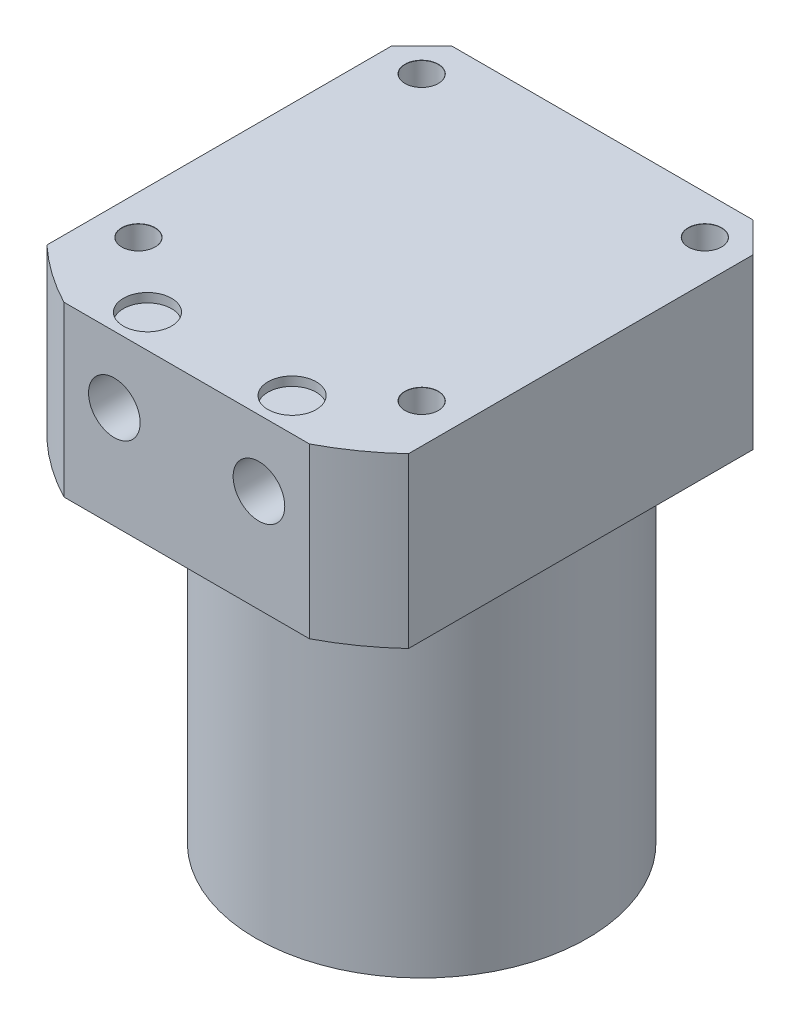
ISO-10303-21;
HEADER;
FILE_DESCRIPTION(('STEP AP214'),'2;1');
FILE_NAME('part.step','',(''),(''),'','','');
FILE_SCHEMA(('AUTOMOTIVE_DESIGN { 1 0 10303 214 1 1 1 1 }'));
ENDSEC;
DATA;
#1=APPLICATION_CONTEXT('core data for automotive mechanical design processes');
#2=APPLICATION_PROTOCOL_DEFINITION('international standard','automotive_design',2000,#1);
#3=PRODUCT_CONTEXT('',#1,'mechanical');
#4=PRODUCT('Part','Part','',(#3));
#5=PRODUCT_RELATED_PRODUCT_CATEGORY('part','',(#4));
#6=PRODUCT_DEFINITION_FORMATION('','',#4);
#7=PRODUCT_DEFINITION_CONTEXT('part definition',#1,'design');
#8=PRODUCT_DEFINITION('design','',#6,#7);
#9=PRODUCT_DEFINITION_SHAPE('','',#8);
#10=(LENGTH_UNIT() NAMED_UNIT(*) SI_UNIT(.MILLI.,.METRE.));
#11=(NAMED_UNIT(*) PLANE_ANGLE_UNIT() SI_UNIT($,.RADIAN.));
#12=(NAMED_UNIT(*) SI_UNIT($,.STERADIAN.) SOLID_ANGLE_UNIT());
#13=UNCERTAINTY_MEASURE_WITH_UNIT(LENGTH_MEASURE(1.E-05),#10,'distance_accuracy_value','');
#14=(GEOMETRIC_REPRESENTATION_CONTEXT(3) GLOBAL_UNCERTAINTY_ASSIGNED_CONTEXT((#13)) GLOBAL_UNIT_ASSIGNED_CONTEXT((#10,
#11,#12)) REPRESENTATION_CONTEXT('',''));
#15=CARTESIAN_POINT('',(0.,0.,0.));
#16=DIRECTION('',(0.,0.,1.));
#17=DIRECTION('',(1.,0.,0.));
#18=AXIS2_PLACEMENT_3D('',#15,#16,#17);
#19=CARTESIAN_POINT('',(-27.5,59.,0.));
#20=DIRECTION('',(0.,-1.,0.));
#21=DIRECTION('',(0.,0.,-1.));
#22=AXIS2_PLACEMENT_3D('',#19,#20,#21);
#23=PLANE('',#22);
#24=CARTESIAN_POINT('',(-23.5,59.,-23.5));
#25=DIRECTION('',(0.,-1.,0.));
#26=DIRECTION('',(0.,0.,-1.));
#27=AXIS2_PLACEMENT_3D('',#24,#25,#26);
#28=CIRCLE('',#27,5.);
#29=CARTESIAN_POINT('',(-23.5,59.,-28.5));
#30=VERTEX_POINT('',#29);
#31=EDGE_CURVE('E336',#30,#30,#28,.T.);
#32=ORIENTED_EDGE('',*,*,#31,.F.);
#33=EDGE_LOOP('',(#32));
#34=FACE_BOUND('',#33,.T.);
#35=CARTESIAN_POINT('',(23.5,59.,-23.5));
#36=DIRECTION('',(0.,-1.,0.));
#37=DIRECTION('',(0.,0.,-1.));
#38=AXIS2_PLACEMENT_3D('',#35,#36,#37);
#39=CIRCLE('',#38,5.);
#40=CARTESIAN_POINT('',(23.5,59.,-28.5));
#41=VERTEX_POINT('',#40);
#42=EDGE_CURVE('E351',#41,#41,#39,.T.);
#43=ORIENTED_EDGE('',*,*,#42,.F.);
#44=EDGE_LOOP('',(#43));
#45=FACE_BOUND('',#44,.T.);
#46=CARTESIAN_POINT('',(23.5,59.,23.5));
#47=DIRECTION('',(0.,-1.,0.));
#48=DIRECTION('',(0.,0.,-1.));
#49=AXIS2_PLACEMENT_3D('',#46,#47,#48);
#50=CIRCLE('',#49,5.);
#51=CARTESIAN_POINT('',(23.5,59.,18.5));
#52=VERTEX_POINT('',#51);
#53=EDGE_CURVE('E366',#52,#52,#50,.T.);
#54=ORIENTED_EDGE('',*,*,#53,.F.);
#55=EDGE_LOOP('',(#54));
#56=FACE_BOUND('',#55,.T.);
#57=CARTESIAN_POINT('',(-23.5,59.,23.5));
#58=DIRECTION('',(0.,-1.,0.));
#59=DIRECTION('',(0.,0.,-1.));
#60=AXIS2_PLACEMENT_3D('',#57,#58,#59);
#61=CIRCLE('',#60,5.);
#62=CARTESIAN_POINT('',(-23.5,59.,18.5));
#63=VERTEX_POINT('',#62);
#64=EDGE_CURVE('E381',#63,#63,#61,.T.);
#65=ORIENTED_EDGE('',*,*,#64,.F.);
#66=EDGE_LOOP('',(#65));
#67=FACE_BOUND('',#66,.T.);
#68=CARTESIAN_POINT('',(0.,59.,0.));
#69=DIRECTION('',(0.,1.,0.));
#70=DIRECTION('',(0.,0.,1.));
#71=AXIS2_PLACEMENT_3D('',#68,#69,#70);
#72=CIRCLE('',#71,27.5);
#73=CARTESIAN_POINT('',(0.,59.,27.5));
#74=VERTEX_POINT('',#73);
#75=EDGE_CURVE('E133',#74,#74,#72,.T.);
#76=ORIENTED_EDGE('',*,*,#75,.T.);
#77=EDGE_LOOP('',(#76));
#78=FACE_BOUND('',#77,.T.);
#79=DIRECTION('',(1.,0.,0.));
#80=VECTOR('',#79,1.);
#81=CARTESIAN_POINT('',(-27.5,59.,-30.));
#82=LINE('',#81,#80);
#83=CARTESIAN_POINT('',(-25.,59.,-30.));
#84=VERTEX_POINT('',#83);
#85=CARTESIAN_POINT('',(25.,59.,-30.));
#86=VERTEX_POINT('',#85);
#87=EDGE_CURVE('E107',#84,#86,#82,.T.);
#88=ORIENTED_EDGE('',*,*,#87,.T.);
#89=DIRECTION('',(-0.707106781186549,0.,-0.707106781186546));
#90=VECTOR('',#89,1.);
#91=CARTESIAN_POINT('',(13.7499999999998,59.,-41.2500000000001));
#92=LINE('',#91,#90);
#93=CARTESIAN_POINT('',(30.,59.,-25.));
#94=VERTEX_POINT('',#93);
#95=EDGE_CURVE('E41',#86,#94,#92,.F.);
#96=ORIENTED_EDGE('',*,*,#95,.T.);
#97=DIRECTION('',(0.,0.,1.));
#98=VECTOR('',#97,1.);
#99=CARTESIAN_POINT('',(30.,59.,0.));
#100=LINE('',#99,#98);
#101=CARTESIAN_POINT('',(30.,59.,32.1869538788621));
#102=VERTEX_POINT('',#101);
#103=EDGE_CURVE('E122',#94,#102,#100,.T.);
#104=ORIENTED_EDGE('',*,*,#103,.T.);
#105=CARTESIAN_POINT('',(0.,59.,0.));
#106=DIRECTION('',(0.,1.,0.));
#107=DIRECTION('',(0.,0.,1.));
#108=AXIS2_PLACEMENT_3D('',#105,#106,#107);
#109=CIRCLE('',#108,44.);
#110=CARTESIAN_POINT('',(20.3715487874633,59.,39.));
#111=VERTEX_POINT('',#110);
#112=EDGE_CURVE('E130',#111,#102,#109,.T.);
#113=ORIENTED_EDGE('',*,*,#112,.F.);
#114=DIRECTION('',(-1.,0.,0.));
#115=VECTOR('',#114,1.);
#116=CARTESIAN_POINT('',(-27.5,59.,39.));
#117=LINE('',#116,#115);
#118=CARTESIAN_POINT('',(-20.3715487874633,59.,39.));
#119=VERTEX_POINT('',#118);
#120=EDGE_CURVE('E177',#111,#119,#117,.T.);
#121=ORIENTED_EDGE('',*,*,#120,.T.);
#122=CARTESIAN_POINT('',(-30.,59.,32.1869538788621));
#123=VERTEX_POINT('',#122);
#124=EDGE_CURVE('E125',#123,#119,#109,.T.);
#125=ORIENTED_EDGE('',*,*,#124,.F.);
#126=DIRECTION('',(0.,0.,-1.));
#127=VECTOR('',#126,1.);
#128=CARTESIAN_POINT('',(-30.,59.,0.));
#129=LINE('',#128,#127);
#130=CARTESIAN_POINT('',(-30.,59.,-25.));
#131=VERTEX_POINT('',#130);
#132=EDGE_CURVE('E113',#123,#131,#129,.T.);
#133=ORIENTED_EDGE('',*,*,#132,.T.);
#134=DIRECTION('',(-0.707106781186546,0.,0.707106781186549));
#135=VECTOR('',#134,1.);
#136=CARTESIAN_POINT('',(-41.25,59.,-13.7499999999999));
#137=LINE('',#136,#135);
#138=EDGE_CURVE('E153',#131,#84,#137,.F.);
#139=ORIENTED_EDGE('',*,*,#138,.T.);
#140=EDGE_LOOP('',(#88,#96,#104,#113,#121,#125,#133,#139));
#141=FACE_BOUND('',#140,.T.);
#142=ADVANCED_FACE('F33',(#34,#45,#56,#67,#78,#141),#23,.T.);
#143=CARTESIAN_POINT('',(0.,87.0508296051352,0.));
#144=DIRECTION('',(0.,1.,0.));
#145=DIRECTION('',(0.,0.,1.));
#146=AXIS2_PLACEMENT_3D('',#143,#144,#145);
#147=CYLINDRICAL_SURFACE('',#146,44.);
#148=ORIENTED_EDGE('',*,*,#112,.T.);
#149=DIRECTION('',(0.,1.,0.));
#150=VECTOR('',#149,1.);
#151=CARTESIAN_POINT('',(30.,87.0508296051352,32.1869538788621));
#152=LINE('',#151,#150);
#153=CARTESIAN_POINT('',(30.,87.,32.1869538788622));
#154=VERTEX_POINT('',#153);
#155=EDGE_CURVE('E126',#102,#154,#152,.T.);
#156=ORIENTED_EDGE('',*,*,#155,.T.);
#157=CARTESIAN_POINT('',(0.,87.,0.));
#158=DIRECTION('',(0.,1.,0.));
#159=DIRECTION('',(0.,0.,1.));
#160=AXIS2_PLACEMENT_3D('',#157,#158,#159);
#161=CIRCLE('',#160,44.);
#162=CARTESIAN_POINT('',(20.3715487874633,87.,39.));
#163=VERTEX_POINT('',#162);
#164=EDGE_CURVE('E121',#163,#154,#161,.T.);
#165=ORIENTED_EDGE('',*,*,#164,.F.);
#166=DIRECTION('',(0.,1.,0.));
#167=VECTOR('',#166,1.);
#168=CARTESIAN_POINT('',(20.3715487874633,87.0508296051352,39.));
#169=LINE('',#168,#167);
#170=EDGE_CURVE('E180',#163,#111,#169,.F.);
#171=ORIENTED_EDGE('',*,*,#170,.T.);
#172=EDGE_LOOP('',(#148,#156,#165,#171));
#173=FACE_BOUND('',#172,.T.);
#174=ADVANCED_FACE('F184',(#173),#147,.T.);
#175=ORIENTED_EDGE('',*,*,#124,.T.);
#176=DIRECTION('',(0.,1.,0.));
#177=VECTOR('',#176,1.);
#178=CARTESIAN_POINT('',(-20.3715487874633,87.0508296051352,39.));
#179=LINE('',#178,#177);
#180=CARTESIAN_POINT('',(-20.3715487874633,87.,39.));
#181=VERTEX_POINT('',#180);
#182=EDGE_CURVE('E120',#119,#181,#179,.T.);
#183=ORIENTED_EDGE('',*,*,#182,.T.);
#184=CARTESIAN_POINT('',(-30.,87.,32.1869538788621));
#185=VERTEX_POINT('',#184);
#186=EDGE_CURVE('E104',#185,#181,#161,.T.);
#187=ORIENTED_EDGE('',*,*,#186,.F.);
#188=DIRECTION('',(0.,1.,0.));
#189=VECTOR('',#188,1.);
#190=CARTESIAN_POINT('',(-30.,87.0508296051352,32.1869538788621));
#191=LINE('',#190,#189);
#192=EDGE_CURVE('E111',#185,#123,#191,.F.);
#193=ORIENTED_EDGE('',*,*,#192,.T.);
#194=EDGE_LOOP('',(#175,#183,#187,#193));
#195=FACE_BOUND('',#194,.T.);
#196=ADVANCED_FACE('F119',(#195),#147,.T.);
#197=CARTESIAN_POINT('',(-44.,87.,0.));
#198=DIRECTION('',(0.,1.,0.));
#199=DIRECTION('',(0.,0.,1.));
#200=AXIS2_PLACEMENT_3D('',#197,#198,#199);
#201=PLANE('',#200);
#202=CARTESIAN_POINT('',(-23.5,87.,-23.5));
#203=DIRECTION('',(0.,-1.,0.));
#204=DIRECTION('',(0.,0.,-1.));
#205=AXIS2_PLACEMENT_3D('',#202,#203,#204);
#206=CIRCLE('',#205,2.77499999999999);
#207=CARTESIAN_POINT('',(-23.5,87.,-26.275));
#208=VERTEX_POINT('',#207);
#209=EDGE_CURVE('E337',#208,#208,#206,.T.);
#210=ORIENTED_EDGE('',*,*,#209,.T.);
#211=EDGE_LOOP('',(#210));
#212=FACE_BOUND('',#211,.T.);
#213=CARTESIAN_POINT('',(23.5,87.,-23.5));
#214=DIRECTION('',(0.,-1.,0.));
#215=DIRECTION('',(0.,0.,-1.));
#216=AXIS2_PLACEMENT_3D('',#213,#214,#215);
#217=CIRCLE('',#216,2.77499999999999);
#218=CARTESIAN_POINT('',(23.5,87.,-26.275));
#219=VERTEX_POINT('',#218);
#220=EDGE_CURVE('E348',#219,#219,#217,.T.);
#221=ORIENTED_EDGE('',*,*,#220,.T.);
#222=EDGE_LOOP('',(#221));
#223=FACE_BOUND('',#222,.T.);
#224=CARTESIAN_POINT('',(23.5,87.,23.5));
#225=DIRECTION('',(0.,-1.,0.));
#226=DIRECTION('',(0.,0.,-1.));
#227=AXIS2_PLACEMENT_3D('',#224,#225,#226);
#228=CIRCLE('',#227,2.77499999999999);
#229=CARTESIAN_POINT('',(23.5,87.,20.725));
#230=VERTEX_POINT('',#229);
#231=EDGE_CURVE('E363',#230,#230,#228,.T.);
#232=ORIENTED_EDGE('',*,*,#231,.T.);
#233=EDGE_LOOP('',(#232));
#234=FACE_BOUND('',#233,.T.);
#235=CARTESIAN_POINT('',(-23.5,87.,23.5));
#236=DIRECTION('',(0.,-1.,0.));
#237=DIRECTION('',(0.,0.,-1.));
#238=AXIS2_PLACEMENT_3D('',#235,#236,#237);
#239=CIRCLE('',#238,2.77499999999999);
#240=CARTESIAN_POINT('',(-23.5,87.,20.725));
#241=VERTEX_POINT('',#240);
#242=EDGE_CURVE('E378',#241,#241,#239,.T.);
#243=ORIENTED_EDGE('',*,*,#242,.T.);
#244=EDGE_LOOP('',(#243));
#245=FACE_BOUND('',#244,.T.);
#246=CARTESIAN_POINT('',(-12.,87.,33.5));
#247=DIRECTION('',(0.,1.,0.));
#248=DIRECTION('',(0.,0.,1.));
#249=AXIS2_PLACEMENT_3D('',#246,#247,#248);
#250=CIRCLE('',#249,4.);
#251=CARTESIAN_POINT('',(-12.,87.,37.5));
#252=VERTEX_POINT('',#251);
#253=EDGE_CURVE('E405',#252,#252,#250,.T.);
#254=ORIENTED_EDGE('',*,*,#253,.F.);
#255=EDGE_LOOP('',(#254));
#256=FACE_BOUND('',#255,.T.);
#257=CARTESIAN_POINT('',(12.,87.,33.5));
#258=DIRECTION('',(0.,1.,0.));
#259=DIRECTION('',(0.,0.,1.));
#260=AXIS2_PLACEMENT_3D('',#257,#258,#259);
#261=CIRCLE('',#260,4.);
#262=CARTESIAN_POINT('',(12.,87.,37.5));
#263=VERTEX_POINT('',#262);
#264=EDGE_CURVE('E170',#263,#263,#261,.T.);
#265=ORIENTED_EDGE('',*,*,#264,.F.);
#266=EDGE_LOOP('',(#265));
#267=FACE_BOUND('',#266,.T.);
#268=DIRECTION('',(0.,0.,-1.));
#269=VECTOR('',#268,1.);
#270=CARTESIAN_POINT('',(30.,87.,0.));
#271=LINE('',#270,#269);
#272=CARTESIAN_POINT('',(30.,87.,-25.));
#273=VERTEX_POINT('',#272);
#274=EDGE_CURVE('E139',#154,#273,#271,.T.);
#275=ORIENTED_EDGE('',*,*,#274,.T.);
#276=DIRECTION('',(0.707106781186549,0.,0.707106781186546));
#277=VECTOR('',#276,1.);
#278=CARTESIAN_POINT('',(5.4999999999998,87.,-49.5000000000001));
#279=LINE('',#278,#277);
#280=CARTESIAN_POINT('',(25.,87.,-30.));
#281=VERTEX_POINT('',#280);
#282=EDGE_CURVE('E147',#273,#281,#279,.F.);
#283=ORIENTED_EDGE('',*,*,#282,.T.);
#284=DIRECTION('',(-1.,0.,0.));
#285=VECTOR('',#284,1.);
#286=CARTESIAN_POINT('',(-30.,87.,-30.));
#287=LINE('',#286,#285);
#288=CARTESIAN_POINT('',(-25.,87.,-30.));
#289=VERTEX_POINT('',#288);
#290=EDGE_CURVE('E108',#281,#289,#287,.T.);
#291=ORIENTED_EDGE('',*,*,#290,.T.);
#292=DIRECTION('',(0.707106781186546,0.,-0.707106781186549));
#293=VECTOR('',#292,1.);
#294=CARTESIAN_POINT('',(-49.4999999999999,87.,-5.49999999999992));
#295=LINE('',#294,#293);
#296=CARTESIAN_POINT('',(-30.,87.,-25.));
#297=VERTEX_POINT('',#296);
#298=EDGE_CURVE('E106',#289,#297,#295,.F.);
#299=ORIENTED_EDGE('',*,*,#298,.T.);
#300=DIRECTION('',(0.,0.,1.));
#301=VECTOR('',#300,1.);
#302=CARTESIAN_POINT('',(-30.,87.,-30.));
#303=LINE('',#302,#301);
#304=EDGE_CURVE('E98',#297,#185,#303,.T.);
#305=ORIENTED_EDGE('',*,*,#304,.T.);
#306=ORIENTED_EDGE('',*,*,#186,.T.);
#307=DIRECTION('',(1.,0.,0.));
#308=VECTOR('',#307,1.);
#309=CARTESIAN_POINT('',(-44.,87.,39.));
#310=LINE('',#309,#308);
#311=EDGE_CURVE('E141',#181,#163,#310,.T.);
#312=ORIENTED_EDGE('',*,*,#311,.T.);
#313=ORIENTED_EDGE('',*,*,#164,.T.);
#314=EDGE_LOOP('',(#275,#283,#291,#299,#305,#306,#312,#313));
#315=FACE_BOUND('',#314,.T.);
#316=ADVANCED_FACE('F101',(#212,#223,#234,#245,#256,#267,#315),#201,.T.);
#317=CARTESIAN_POINT('',(0.,0.,0.));
#318=DIRECTION('',(0.,-1.,0.));
#319=DIRECTION('',(0.,0.,-1.));
#320=AXIS2_PLACEMENT_3D('',#317,#318,#319);
#321=PLANE('',#320);
#322=CARTESIAN_POINT('',(0.,0.,0.));
#323=DIRECTION('',(0.,1.,0.));
#324=DIRECTION('',(0.,0.,1.));
#325=AXIS2_PLACEMENT_3D('',#322,#323,#324);
#326=CIRCLE('',#325,27.5);
#327=CARTESIAN_POINT('',(0.,0.,27.5));
#328=VERTEX_POINT('',#327);
#329=EDGE_CURVE('E136',#328,#328,#326,.T.);
#330=ORIENTED_EDGE('',*,*,#329,.F.);
#331=EDGE_LOOP('',(#330));
#332=FACE_BOUND('',#331,.T.);
#333=ADVANCED_FACE('F212',(#332),#321,.T.);
#334=CARTESIAN_POINT('',(0.,87.0508296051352,0.));
#335=DIRECTION('',(0.,1.,0.));
#336=DIRECTION('',(0.,0.,1.));
#337=AXIS2_PLACEMENT_3D('',#334,#335,#336);
#338=CYLINDRICAL_SURFACE('',#337,27.5);
#339=ORIENTED_EDGE('',*,*,#329,.T.);
#340=EDGE_LOOP('',(#339));
#341=FACE_BOUND('',#340,.T.);
#342=ORIENTED_EDGE('',*,*,#75,.F.);
#343=EDGE_LOOP('',(#342));
#344=FACE_BOUND('',#343,.T.);
#345=ADVANCED_FACE('F209',(#341,#344),#338,.T.);
#346=CARTESIAN_POINT('',(-30.,0.,-30.));
#347=DIRECTION('',(0.,0.,-1.));
#348=DIRECTION('',(-1.,0.,0.));
#349=AXIS2_PLACEMENT_3D('',#346,#347,#348);
#350=PLANE('',#349);
#351=ORIENTED_EDGE('',*,*,#290,.F.);
#352=DIRECTION('',(0.,-1.,0.));
#353=VECTOR('',#352,1.);
#354=CARTESIAN_POINT('',(25.,0.,-30.));
#355=LINE('',#354,#353);
#356=EDGE_CURVE('E54',#281,#86,#355,.T.);
#357=ORIENTED_EDGE('',*,*,#356,.T.);
#358=ORIENTED_EDGE('',*,*,#87,.F.);
#359=DIRECTION('',(0.,1.,0.));
#360=VECTOR('',#359,1.);
#361=CARTESIAN_POINT('',(-25.,0.,-30.));
#362=LINE('',#361,#360);
#363=EDGE_CURVE('E149',#84,#289,#362,.T.);
#364=ORIENTED_EDGE('',*,*,#363,.T.);
#365=EDGE_LOOP('',(#351,#357,#358,#364));
#366=FACE_BOUND('',#365,.T.);
#367=ADVANCED_FACE('F165',(#366),#350,.T.);
#368=CARTESIAN_POINT('',(-30.,0.,-30.));
#369=DIRECTION('',(-1.,0.,0.));
#370=DIRECTION('',(0.,0.,1.));
#371=AXIS2_PLACEMENT_3D('',#368,#369,#370);
#372=PLANE('',#371);
#373=ORIENTED_EDGE('',*,*,#304,.F.);
#374=DIRECTION('',(0.,-1.,0.));
#375=VECTOR('',#374,1.);
#376=CARTESIAN_POINT('',(-30.,0.,-25.));
#377=LINE('',#376,#375);
#378=EDGE_CURVE('E12',#297,#131,#377,.T.);
#379=ORIENTED_EDGE('',*,*,#378,.T.);
#380=ORIENTED_EDGE('',*,*,#132,.F.);
#381=ORIENTED_EDGE('',*,*,#192,.F.);
#382=EDGE_LOOP('',(#373,#379,#380,#381));
#383=FACE_BOUND('',#382,.T.);
#384=ADVANCED_FACE('F112',(#383),#372,.T.);
#385=CARTESIAN_POINT('',(30.,0.,-30.));
#386=DIRECTION('',(1.,0.,0.));
#387=DIRECTION('',(0.,0.,-1.));
#388=AXIS2_PLACEMENT_3D('',#385,#386,#387);
#389=PLANE('',#388);
#390=ORIENTED_EDGE('',*,*,#103,.F.);
#391=DIRECTION('',(0.,1.,0.));
#392=VECTOR('',#391,1.);
#393=CARTESIAN_POINT('',(30.,0.,-25.));
#394=LINE('',#393,#392);
#395=EDGE_CURVE('E143',#94,#273,#394,.T.);
#396=ORIENTED_EDGE('',*,*,#395,.T.);
#397=ORIENTED_EDGE('',*,*,#274,.F.);
#398=ORIENTED_EDGE('',*,*,#155,.F.);
#399=EDGE_LOOP('',(#390,#396,#397,#398));
#400=FACE_BOUND('',#399,.T.);
#401=ADVANCED_FACE('F162',(#400),#389,.T.);
#402=CARTESIAN_POINT('',(-30.,0.,39.));
#403=DIRECTION('',(0.,0.,1.));
#404=DIRECTION('',(1.,0.,0.));
#405=AXIS2_PLACEMENT_3D('',#402,#403,#404);
#406=PLANE('',#405);
#407=CARTESIAN_POINT('',(-12.,76.,39.));
#408=DIRECTION('',(0.,0.,1.));
#409=DIRECTION('',(1.,0.,0.));
#410=AXIS2_PLACEMENT_3D('',#407,#408,#409);
#411=CIRCLE('',#410,4.283);
#412=CARTESIAN_POINT('',(-7.717,76.,39.));
#413=VERTEX_POINT('',#412);
#414=EDGE_CURVE('E393',#413,#413,#411,.T.);
#415=ORIENTED_EDGE('',*,*,#414,.F.);
#416=EDGE_LOOP('',(#415));
#417=FACE_BOUND('',#416,.T.);
#418=CARTESIAN_POINT('',(12.,76.,39.));
#419=DIRECTION('',(0.,0.,1.));
#420=DIRECTION('',(1.,0.,0.));
#421=AXIS2_PLACEMENT_3D('',#418,#419,#420);
#422=CIRCLE('',#421,4.283);
#423=CARTESIAN_POINT('',(16.283,76.,39.));
#424=VERTEX_POINT('',#423);
#425=EDGE_CURVE('E399',#424,#424,#422,.T.);
#426=ORIENTED_EDGE('',*,*,#425,.F.);
#427=EDGE_LOOP('',(#426));
#428=FACE_BOUND('',#427,.T.);
#429=ORIENTED_EDGE('',*,*,#311,.F.);
#430=ORIENTED_EDGE('',*,*,#182,.F.);
#431=ORIENTED_EDGE('',*,*,#120,.F.);
#432=ORIENTED_EDGE('',*,*,#170,.F.);
#433=EDGE_LOOP('',(#429,#430,#431,#432));
#434=FACE_BOUND('',#433,.T.);
#435=ADVANCED_FACE('F186',(#417,#428,#434),#406,.T.);
#436=CARTESIAN_POINT('',(30.,0.,-25.));
#437=DIRECTION('',(-0.707106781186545,0.,0.707106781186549));
#438=DIRECTION('',(0.707106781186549,0.,0.707106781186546));
#439=AXIS2_PLACEMENT_3D('',#436,#437,#438);
#440=PLANE('',#439);
#441=ORIENTED_EDGE('',*,*,#95,.F.);
#442=ORIENTED_EDGE('',*,*,#356,.F.);
#443=ORIENTED_EDGE('',*,*,#282,.F.);
#444=ORIENTED_EDGE('',*,*,#395,.F.);
#445=EDGE_LOOP('',(#441,#442,#443,#444));
#446=FACE_BOUND('',#445,.T.);
#447=ADVANCED_FACE('F164',(#446),#440,.F.);
#448=CARTESIAN_POINT('',(-25.,0.,-30.));
#449=DIRECTION('',(0.707106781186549,0.,0.707106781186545));
#450=DIRECTION('',(0.707106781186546,0.,-0.707106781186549));
#451=AXIS2_PLACEMENT_3D('',#448,#449,#450);
#452=PLANE('',#451);
#453=ORIENTED_EDGE('',*,*,#138,.F.);
#454=ORIENTED_EDGE('',*,*,#378,.F.);
#455=ORIENTED_EDGE('',*,*,#298,.F.);
#456=ORIENTED_EDGE('',*,*,#363,.F.);
#457=EDGE_LOOP('',(#453,#454,#455,#456));
#458=FACE_BOUND('',#457,.T.);
#459=ADVANCED_FACE('F35',(#458),#452,.F.);
#460=CARTESIAN_POINT('',(12.,85.5,33.5));
#461=DIRECTION('',(0.,-1.,0.));
#462=DIRECTION('',(0.,0.,-1.));
#463=AXIS2_PLACEMENT_3D('',#460,#461,#462);
#464=PLANE('',#463);
#465=CARTESIAN_POINT('',(12.,85.5,33.5));
#466=DIRECTION('',(0.,1.,0.));
#467=DIRECTION('',(0.,0.,1.));
#468=AXIS2_PLACEMENT_3D('',#465,#466,#467);
#469=CIRCLE('',#468,4.);
#470=CARTESIAN_POINT('',(12.,85.5,37.5));
#471=VERTEX_POINT('',#470);
#472=EDGE_CURVE('E167',#471,#471,#469,.T.);
#473=ORIENTED_EDGE('',*,*,#472,.T.);
#474=EDGE_LOOP('',(#473));
#475=FACE_BOUND('',#474,.T.);
#476=ADVANCED_FACE('F190',(#475),#464,.F.);
#477=CARTESIAN_POINT('',(12.,87.,33.5));
#478=DIRECTION('',(0.,1.,0.));
#479=DIRECTION('',(0.,0.,1.));
#480=AXIS2_PLACEMENT_3D('',#477,#478,#479);
#481=CYLINDRICAL_SURFACE('',#480,4.);
#482=ORIENTED_EDGE('',*,*,#472,.F.);
#483=EDGE_LOOP('',(#482));
#484=FACE_BOUND('',#483,.T.);
#485=ORIENTED_EDGE('',*,*,#264,.T.);
#486=EDGE_LOOP('',(#485));
#487=FACE_BOUND('',#486,.T.);
#488=ADVANCED_FACE('F195',(#484,#487),#481,.F.);
#489=CARTESIAN_POINT('',(-12.,85.5,33.5));
#490=DIRECTION('',(0.,-1.,0.));
#491=DIRECTION('',(0.,0.,-1.));
#492=AXIS2_PLACEMENT_3D('',#489,#490,#491);
#493=PLANE('',#492);
#494=CARTESIAN_POINT('',(-12.,85.5,33.5));
#495=DIRECTION('',(0.,1.,0.));
#496=DIRECTION('',(0.,0.,1.));
#497=AXIS2_PLACEMENT_3D('',#494,#495,#496);
#498=CIRCLE('',#497,4.);
#499=CARTESIAN_POINT('',(-12.,85.5,37.5));
#500=VERTEX_POINT('',#499);
#501=EDGE_CURVE('E408',#500,#500,#498,.T.);
#502=ORIENTED_EDGE('',*,*,#501,.T.);
#503=EDGE_LOOP('',(#502));
#504=FACE_BOUND('',#503,.T.);
#505=ADVANCED_FACE('F241',(#504),#493,.F.);
#506=CARTESIAN_POINT('',(-12.,87.,33.5));
#507=DIRECTION('',(0.,1.,0.));
#508=DIRECTION('',(0.,0.,1.));
#509=AXIS2_PLACEMENT_3D('',#506,#507,#508);
#510=CYLINDRICAL_SURFACE('',#509,4.);
#511=ORIENTED_EDGE('',*,*,#501,.F.);
#512=EDGE_LOOP('',(#511));
#513=FACE_BOUND('',#512,.T.);
#514=ORIENTED_EDGE('',*,*,#253,.T.);
#515=EDGE_LOOP('',(#514));
#516=FACE_BOUND('',#515,.T.);
#517=ADVANCED_FACE('F245',(#513,#516),#510,.F.);
#518=CARTESIAN_POINT('',(12.,76.,16.82));
#519=DIRECTION('',(0.,0.,-1.));
#520=DIRECTION('',(-1.,0.,0.));
#521=AXIS2_PLACEMENT_3D('',#518,#519,#520);
#522=PLANE('',#521);
#523=CARTESIAN_POINT('',(12.,76.,16.82));
#524=DIRECTION('',(0.,0.,1.));
#525=DIRECTION('',(1.,0.,0.));
#526=AXIS2_PLACEMENT_3D('',#523,#524,#525);
#527=CIRCLE('',#526,4.283);
#528=CARTESIAN_POINT('',(16.283,76.,16.82));
#529=VERTEX_POINT('',#528);
#530=EDGE_CURVE('E402',#529,#529,#527,.T.);
#531=ORIENTED_EDGE('',*,*,#530,.T.);
#532=EDGE_LOOP('',(#531));
#533=FACE_BOUND('',#532,.T.);
#534=ADVANCED_FACE('F249',(#533),#522,.F.);
#535=CARTESIAN_POINT('',(12.,76.,39.));
#536=DIRECTION('',(0.,0.,1.));
#537=DIRECTION('',(1.,0.,0.));
#538=AXIS2_PLACEMENT_3D('',#535,#536,#537);
#539=CYLINDRICAL_SURFACE('',#538,4.283);
#540=ORIENTED_EDGE('',*,*,#530,.F.);
#541=EDGE_LOOP('',(#540));
#542=FACE_BOUND('',#541,.T.);
#543=ORIENTED_EDGE('',*,*,#425,.T.);
#544=EDGE_LOOP('',(#543));
#545=FACE_BOUND('',#544,.T.);
#546=ADVANCED_FACE('F253',(#542,#545),#539,.F.);
#547=CARTESIAN_POINT('',(-12.,76.,16.82));
#548=DIRECTION('',(0.,0.,-1.));
#549=DIRECTION('',(-1.,0.,0.));
#550=AXIS2_PLACEMENT_3D('',#547,#548,#549);
#551=PLANE('',#550);
#552=CARTESIAN_POINT('',(-12.,76.,16.82));
#553=DIRECTION('',(0.,0.,1.));
#554=DIRECTION('',(1.,0.,0.));
#555=AXIS2_PLACEMENT_3D('',#552,#553,#554);
#556=CIRCLE('',#555,4.283);
#557=CARTESIAN_POINT('',(-7.717,76.,16.82));
#558=VERTEX_POINT('',#557);
#559=EDGE_CURVE('E396',#558,#558,#556,.T.);
#560=ORIENTED_EDGE('',*,*,#559,.T.);
#561=EDGE_LOOP('',(#560));
#562=FACE_BOUND('',#561,.T.);
#563=ADVANCED_FACE('F257',(#562),#551,.F.);
#564=CARTESIAN_POINT('',(-12.,76.,39.));
#565=DIRECTION('',(0.,0.,1.));
#566=DIRECTION('',(1.,0.,0.));
#567=AXIS2_PLACEMENT_3D('',#564,#565,#566);
#568=CYLINDRICAL_SURFACE('',#567,4.283);
#569=ORIENTED_EDGE('',*,*,#559,.F.);
#570=EDGE_LOOP('',(#569));
#571=FACE_BOUND('',#570,.T.);
#572=ORIENTED_EDGE('',*,*,#414,.T.);
#573=EDGE_LOOP('',(#572));
#574=FACE_BOUND('',#573,.T.);
#575=ADVANCED_FACE('F261',(#571,#574),#568,.F.);
#576=CARTESIAN_POINT('',(-23.5,86.975,23.5));
#577=DIRECTION('',(0.,1.,0.));
#578=DIRECTION('',(0.,0.,1.));
#579=AXIS2_PLACEMENT_3D('',#576,#577,#578);
#580=CONICAL_SURFACE('',#579,2.74999999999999,0.785398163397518);
#581=ORIENTED_EDGE('',*,*,#242,.F.);
#582=EDGE_LOOP('',(#581));
#583=FACE_BOUND('',#582,.T.);
#584=CARTESIAN_POINT('',(-23.5,86.975,23.5));
#585=DIRECTION('',(0.,-1.,0.));
#586=DIRECTION('',(0.,0.,-1.));
#587=AXIS2_PLACEMENT_3D('',#584,#585,#586);
#588=CIRCLE('',#587,2.74999999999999);
#589=CARTESIAN_POINT('',(-23.5,86.975,20.75));
#590=VERTEX_POINT('',#589);
#591=EDGE_CURVE('E390',#590,#590,#588,.T.);
#592=ORIENTED_EDGE('',*,*,#591,.T.);
#593=EDGE_LOOP('',(#592));
#594=FACE_BOUND('',#593,.T.);
#595=ADVANCED_FACE('F265',(#583,#594),#580,.F.);
#596=CARTESIAN_POINT('',(-23.5,59.,23.5));
#597=DIRECTION('',(0.,-1.,0.));
#598=DIRECTION('',(0.,0.,-1.));
#599=AXIS2_PLACEMENT_3D('',#596,#597,#598);
#600=CYLINDRICAL_SURFACE('',#599,2.75);
#601=ORIENTED_EDGE('',*,*,#591,.F.);
#602=EDGE_LOOP('',(#601));
#603=FACE_BOUND('',#602,.T.);
#604=CARTESIAN_POINT('',(-23.5,64.,23.5));
#605=DIRECTION('',(0.,-1.,0.));
#606=DIRECTION('',(0.,0.,-1.));
#607=AXIS2_PLACEMENT_3D('',#604,#605,#606);
#608=CIRCLE('',#607,2.75);
#609=CARTESIAN_POINT('',(-23.5,64.,20.75));
#610=VERTEX_POINT('',#609);
#611=EDGE_CURVE('E387',#610,#610,#608,.T.);
#612=ORIENTED_EDGE('',*,*,#611,.T.);
#613=EDGE_LOOP('',(#612));
#614=FACE_BOUND('',#613,.T.);
#615=ADVANCED_FACE('F269',(#603,#614),#600,.F.);
#616=CARTESIAN_POINT('',(-20.75,64.,23.5));
#617=DIRECTION('',(0.,1.,0.));
#618=DIRECTION('',(0.,0.,1.));
#619=AXIS2_PLACEMENT_3D('',#616,#617,#618);
#620=PLANE('',#619);
#621=ORIENTED_EDGE('',*,*,#611,.F.);
#622=EDGE_LOOP('',(#621));
#623=FACE_BOUND('',#622,.T.);
#624=CARTESIAN_POINT('',(-23.5,64.,23.5));
#625=DIRECTION('',(0.,-1.,0.));
#626=DIRECTION('',(0.,0.,-1.));
#627=AXIS2_PLACEMENT_3D('',#624,#625,#626);
#628=CIRCLE('',#627,5.);
#629=CARTESIAN_POINT('',(-23.5,64.,18.5));
#630=VERTEX_POINT('',#629);
#631=EDGE_CURVE('E384',#630,#630,#628,.T.);
#632=ORIENTED_EDGE('',*,*,#631,.T.);
#633=EDGE_LOOP('',(#632));
#634=FACE_BOUND('',#633,.T.);
#635=ADVANCED_FACE('F273',(#623,#634),#620,.F.);
#636=CARTESIAN_POINT('',(-23.5,59.,23.5));
#637=DIRECTION('',(0.,-1.,0.));
#638=DIRECTION('',(0.,0.,-1.));
#639=AXIS2_PLACEMENT_3D('',#636,#637,#638);
#640=CYLINDRICAL_SURFACE('',#639,5.);
#641=ORIENTED_EDGE('',*,*,#631,.F.);
#642=EDGE_LOOP('',(#641));
#643=FACE_BOUND('',#642,.T.);
#644=ORIENTED_EDGE('',*,*,#64,.T.);
#645=EDGE_LOOP('',(#644));
#646=FACE_BOUND('',#645,.T.);
#647=ADVANCED_FACE('F277',(#643,#646),#640,.F.);
#648=CARTESIAN_POINT('',(23.5,86.975,23.5));
#649=DIRECTION('',(0.,1.,0.));
#650=DIRECTION('',(0.,0.,1.));
#651=AXIS2_PLACEMENT_3D('',#648,#649,#650);
#652=CONICAL_SURFACE('',#651,2.74999999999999,0.785398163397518);
#653=ORIENTED_EDGE('',*,*,#231,.F.);
#654=EDGE_LOOP('',(#653));
#655=FACE_BOUND('',#654,.T.);
#656=CARTESIAN_POINT('',(23.5,86.975,23.5));
#657=DIRECTION('',(0.,-1.,0.));
#658=DIRECTION('',(0.,0.,-1.));
#659=AXIS2_PLACEMENT_3D('',#656,#657,#658);
#660=CIRCLE('',#659,2.74999999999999);
#661=CARTESIAN_POINT('',(23.5,86.975,20.75));
#662=VERTEX_POINT('',#661);
#663=EDGE_CURVE('E375',#662,#662,#660,.T.);
#664=ORIENTED_EDGE('',*,*,#663,.T.);
#665=EDGE_LOOP('',(#664));
#666=FACE_BOUND('',#665,.T.);
#667=ADVANCED_FACE('F281',(#655,#666),#652,.F.);
#668=CARTESIAN_POINT('',(23.5,59.,23.5));
#669=DIRECTION('',(0.,-1.,0.));
#670=DIRECTION('',(0.,0.,-1.));
#671=AXIS2_PLACEMENT_3D('',#668,#669,#670);
#672=CYLINDRICAL_SURFACE('',#671,2.75);
#673=ORIENTED_EDGE('',*,*,#663,.F.);
#674=EDGE_LOOP('',(#673));
#675=FACE_BOUND('',#674,.T.);
#676=CARTESIAN_POINT('',(23.5,64.,23.5));
#677=DIRECTION('',(0.,-1.,0.));
#678=DIRECTION('',(0.,0.,-1.));
#679=AXIS2_PLACEMENT_3D('',#676,#677,#678);
#680=CIRCLE('',#679,2.75);
#681=CARTESIAN_POINT('',(23.5,64.,20.75));
#682=VERTEX_POINT('',#681);
#683=EDGE_CURVE('E372',#682,#682,#680,.T.);
#684=ORIENTED_EDGE('',*,*,#683,.T.);
#685=EDGE_LOOP('',(#684));
#686=FACE_BOUND('',#685,.T.);
#687=ADVANCED_FACE('F285',(#675,#686),#672,.F.);
#688=CARTESIAN_POINT('',(26.25,64.,23.5));
#689=DIRECTION('',(0.,1.,0.));
#690=DIRECTION('',(0.,0.,1.));
#691=AXIS2_PLACEMENT_3D('',#688,#689,#690);
#692=PLANE('',#691);
#693=ORIENTED_EDGE('',*,*,#683,.F.);
#694=EDGE_LOOP('',(#693));
#695=FACE_BOUND('',#694,.T.);
#696=CARTESIAN_POINT('',(23.5,64.,23.5));
#697=DIRECTION('',(0.,-1.,0.));
#698=DIRECTION('',(0.,0.,-1.));
#699=AXIS2_PLACEMENT_3D('',#696,#697,#698);
#700=CIRCLE('',#699,5.);
#701=CARTESIAN_POINT('',(23.5,64.,18.5));
#702=VERTEX_POINT('',#701);
#703=EDGE_CURVE('E369',#702,#702,#700,.T.);
#704=ORIENTED_EDGE('',*,*,#703,.T.);
#705=EDGE_LOOP('',(#704));
#706=FACE_BOUND('',#705,.T.);
#707=ADVANCED_FACE('F289',(#695,#706),#692,.F.);
#708=CARTESIAN_POINT('',(23.5,59.,23.5));
#709=DIRECTION('',(0.,-1.,0.));
#710=DIRECTION('',(0.,0.,-1.));
#711=AXIS2_PLACEMENT_3D('',#708,#709,#710);
#712=CYLINDRICAL_SURFACE('',#711,5.);
#713=ORIENTED_EDGE('',*,*,#703,.F.);
#714=EDGE_LOOP('',(#713));
#715=FACE_BOUND('',#714,.T.);
#716=ORIENTED_EDGE('',*,*,#53,.T.);
#717=EDGE_LOOP('',(#716));
#718=FACE_BOUND('',#717,.T.);
#719=ADVANCED_FACE('F293',(#715,#718),#712,.F.);
#720=CARTESIAN_POINT('',(23.5,86.975,-23.5));
#721=DIRECTION('',(0.,1.,0.));
#722=DIRECTION('',(0.,0.,1.));
#723=AXIS2_PLACEMENT_3D('',#720,#721,#722);
#724=CONICAL_SURFACE('',#723,2.74999999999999,0.785398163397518);
#725=ORIENTED_EDGE('',*,*,#220,.F.);
#726=EDGE_LOOP('',(#725));
#727=FACE_BOUND('',#726,.T.);
#728=CARTESIAN_POINT('',(23.5,86.975,-23.5));
#729=DIRECTION('',(0.,-1.,0.));
#730=DIRECTION('',(0.,0.,-1.));
#731=AXIS2_PLACEMENT_3D('',#728,#729,#730);
#732=CIRCLE('',#731,2.74999999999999);
#733=CARTESIAN_POINT('',(23.5,86.975,-26.25));
#734=VERTEX_POINT('',#733);
#735=EDGE_CURVE('E360',#734,#734,#732,.T.);
#736=ORIENTED_EDGE('',*,*,#735,.T.);
#737=EDGE_LOOP('',(#736));
#738=FACE_BOUND('',#737,.T.);
#739=ADVANCED_FACE('F297',(#727,#738),#724,.F.);
#740=CARTESIAN_POINT('',(23.5,59.,-23.5));
#741=DIRECTION('',(0.,-1.,0.));
#742=DIRECTION('',(0.,0.,-1.));
#743=AXIS2_PLACEMENT_3D('',#740,#741,#742);
#744=CYLINDRICAL_SURFACE('',#743,2.75);
#745=ORIENTED_EDGE('',*,*,#735,.F.);
#746=EDGE_LOOP('',(#745));
#747=FACE_BOUND('',#746,.T.);
#748=CARTESIAN_POINT('',(23.5,64.,-23.5));
#749=DIRECTION('',(0.,-1.,0.));
#750=DIRECTION('',(0.,0.,-1.));
#751=AXIS2_PLACEMENT_3D('',#748,#749,#750);
#752=CIRCLE('',#751,2.75);
#753=CARTESIAN_POINT('',(23.5,64.,-26.25));
#754=VERTEX_POINT('',#753);
#755=EDGE_CURVE('E357',#754,#754,#752,.T.);
#756=ORIENTED_EDGE('',*,*,#755,.T.);
#757=EDGE_LOOP('',(#756));
#758=FACE_BOUND('',#757,.T.);
#759=ADVANCED_FACE('F301',(#747,#758),#744,.F.);
#760=CARTESIAN_POINT('',(26.25,64.,-23.5));
#761=DIRECTION('',(0.,1.,0.));
#762=DIRECTION('',(0.,0.,1.));
#763=AXIS2_PLACEMENT_3D('',#760,#761,#762);
#764=PLANE('',#763);
#765=ORIENTED_EDGE('',*,*,#755,.F.);
#766=EDGE_LOOP('',(#765));
#767=FACE_BOUND('',#766,.T.);
#768=CARTESIAN_POINT('',(23.5,64.,-23.5));
#769=DIRECTION('',(0.,-1.,0.));
#770=DIRECTION('',(0.,0.,-1.));
#771=AXIS2_PLACEMENT_3D('',#768,#769,#770);
#772=CIRCLE('',#771,5.);
#773=CARTESIAN_POINT('',(23.5,64.,-28.5));
#774=VERTEX_POINT('',#773);
#775=EDGE_CURVE('E354',#774,#774,#772,.T.);
#776=ORIENTED_EDGE('',*,*,#775,.T.);
#777=EDGE_LOOP('',(#776));
#778=FACE_BOUND('',#777,.T.);
#779=ADVANCED_FACE('F305',(#767,#778),#764,.F.);
#780=CARTESIAN_POINT('',(23.5,59.,-23.5));
#781=DIRECTION('',(0.,-1.,0.));
#782=DIRECTION('',(0.,0.,-1.));
#783=AXIS2_PLACEMENT_3D('',#780,#781,#782);
#784=CYLINDRICAL_SURFACE('',#783,5.);
#785=ORIENTED_EDGE('',*,*,#775,.F.);
#786=EDGE_LOOP('',(#785));
#787=FACE_BOUND('',#786,.T.);
#788=ORIENTED_EDGE('',*,*,#42,.T.);
#789=EDGE_LOOP('',(#788));
#790=FACE_BOUND('',#789,.T.);
#791=ADVANCED_FACE('F309',(#787,#790),#784,.F.);
#792=CARTESIAN_POINT('',(-23.5,86.975,-23.5));
#793=DIRECTION('',(0.,1.,0.));
#794=DIRECTION('',(0.,0.,1.));
#795=AXIS2_PLACEMENT_3D('',#792,#793,#794);
#796=CONICAL_SURFACE('',#795,2.74999999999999,0.785398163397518);
#797=ORIENTED_EDGE('',*,*,#209,.F.);
#798=EDGE_LOOP('',(#797));
#799=FACE_BOUND('',#798,.T.);
#800=CARTESIAN_POINT('',(-23.5,86.975,-23.5));
#801=DIRECTION('',(0.,-1.,0.));
#802=DIRECTION('',(0.,0.,-1.));
#803=AXIS2_PLACEMENT_3D('',#800,#801,#802);
#804=CIRCLE('',#803,2.74999999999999);
#805=CARTESIAN_POINT('',(-23.5,86.975,-26.25));
#806=VERTEX_POINT('',#805);
#807=EDGE_CURVE('E345',#806,#806,#804,.T.);
#808=ORIENTED_EDGE('',*,*,#807,.T.);
#809=EDGE_LOOP('',(#808));
#810=FACE_BOUND('',#809,.T.);
#811=ADVANCED_FACE('F313',(#799,#810),#796,.F.);
#812=CARTESIAN_POINT('',(-23.5,59.,-23.5));
#813=DIRECTION('',(0.,-1.,0.));
#814=DIRECTION('',(0.,0.,-1.));
#815=AXIS2_PLACEMENT_3D('',#812,#813,#814);
#816=CYLINDRICAL_SURFACE('',#815,2.75);
#817=ORIENTED_EDGE('',*,*,#807,.F.);
#818=EDGE_LOOP('',(#817));
#819=FACE_BOUND('',#818,.T.);
#820=CARTESIAN_POINT('',(-23.5,64.,-23.5));
#821=DIRECTION('',(0.,-1.,0.));
#822=DIRECTION('',(0.,0.,-1.));
#823=AXIS2_PLACEMENT_3D('',#820,#821,#822);
#824=CIRCLE('',#823,2.75);
#825=CARTESIAN_POINT('',(-23.5,64.,-26.25));
#826=VERTEX_POINT('',#825);
#827=EDGE_CURVE('E339',#826,#826,#824,.T.);
#828=ORIENTED_EDGE('',*,*,#827,.T.);
#829=EDGE_LOOP('',(#828));
#830=FACE_BOUND('',#829,.T.);
#831=ADVANCED_FACE('F317',(#819,#830),#816,.F.);
#832=CARTESIAN_POINT('',(-20.75,64.,-23.5));
#833=DIRECTION('',(0.,1.,0.));
#834=DIRECTION('',(0.,0.,1.));
#835=AXIS2_PLACEMENT_3D('',#832,#833,#834);
#836=PLANE('',#835);
#837=ORIENTED_EDGE('',*,*,#827,.F.);
#838=EDGE_LOOP('',(#837));
#839=FACE_BOUND('',#838,.T.);
#840=CARTESIAN_POINT('',(-23.5,64.,-23.5));
#841=DIRECTION('',(0.,-1.,0.));
#842=DIRECTION('',(0.,0.,-1.));
#843=AXIS2_PLACEMENT_3D('',#840,#841,#842);
#844=CIRCLE('',#843,5.);
#845=CARTESIAN_POINT('',(-23.5,64.,-28.5));
#846=VERTEX_POINT('',#845);
#847=EDGE_CURVE('E334',#846,#846,#844,.T.);
#848=ORIENTED_EDGE('',*,*,#847,.T.);
#849=EDGE_LOOP('',(#848));
#850=FACE_BOUND('',#849,.T.);
#851=ADVANCED_FACE('F321',(#839,#850),#836,.F.);
#852=CARTESIAN_POINT('',(-23.5,59.,-23.5));
#853=DIRECTION('',(0.,-1.,0.));
#854=DIRECTION('',(0.,0.,-1.));
#855=AXIS2_PLACEMENT_3D('',#852,#853,#854);
#856=CYLINDRICAL_SURFACE('',#855,5.);
#857=ORIENTED_EDGE('',*,*,#847,.F.);
#858=EDGE_LOOP('',(#857));
#859=FACE_BOUND('',#858,.T.);
#860=ORIENTED_EDGE('',*,*,#31,.T.);
#861=EDGE_LOOP('',(#860));
#862=FACE_BOUND('',#861,.T.);
#863=ADVANCED_FACE('F325',(#859,#862),#856,.F.);
#864=CLOSED_SHELL('',(#142,#174,#196,#316,#333,#345,#367,#384,#401,#435,#447,#459,#476,#488,
#505,#517,#534,#546,#563,#575,#595,#615,#635,#647,#667,#687,#707,#719,#739,#759,#779,#791,#811,
#831,#851,#863));
#865=MANIFOLD_SOLID_BREP('B2',#864);
#866=ADVANCED_BREP_SHAPE_REPRESENTATION('',(#18,#865),#14);
#867=SHAPE_DEFINITION_REPRESENTATION(#9,#866);
ENDSEC;
END-ISO-10303-21;
